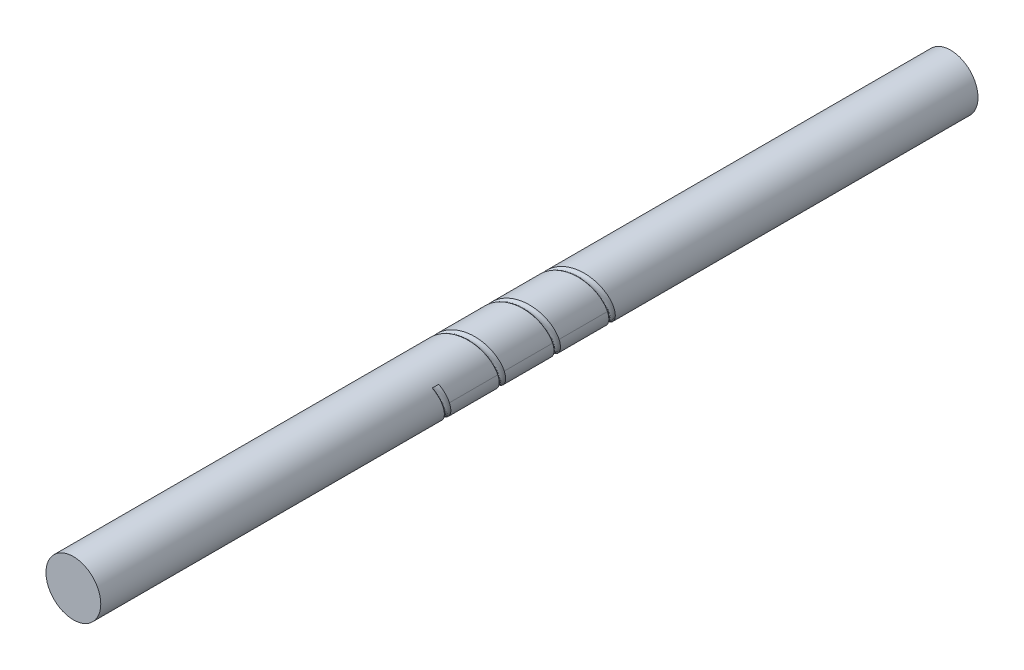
from build123d import *

# Parameters (mm, degrees)
SKETCH1_R              = 25
BOSS_EXTRUDE1_DEPTH    = 800
CUT_SWEEP1_PITCH       = 50
CUT_SWEEP1_HEIGHT      = 180
CUT_SWEEP1_RADIUS      = 27.646
CUT_SWEEP1_START_ANGLE = -180
SKETCH3_R              = 3.969


with BuildPart() as part:
    # Sketch1 → Boss-Extrude1 (new body)
    with BuildSketch(Plane.XY):
        Circle(SKETCH1_R)
    extrude(amount=BOSS_EXTRUDE1_DEPTH)

    # Cut-Sweep1: sweep along a helix
    with BuildLine() as cut_sweep1_path:
        add(Helix(CUT_SWEEP1_PITCH, CUT_SWEEP1_HEIGHT, CUT_SWEEP1_RADIUS, center=(0, 0, 310), direction=(0, 0, 1), mode=Mode.PRIVATE).rotate(Axis((0, 0, 310), (0, 0, 1)), CUT_SWEEP1_START_ANGLE))
    # Sketch3 → Cut-Sweep1 (sweep, cut)
    with BuildSketch(Plane(origin=(0, 0, 0), x_dir=(1, 0, 0), z_dir=(0, 1, 0))):
        with Locations((-27.646, -310)):
            Circle(SKETCH3_R)
    sweep(path=cut_sweep1_path.line, is_frenet=True, mode=Mode.SUBTRACT)


solid = part.part
